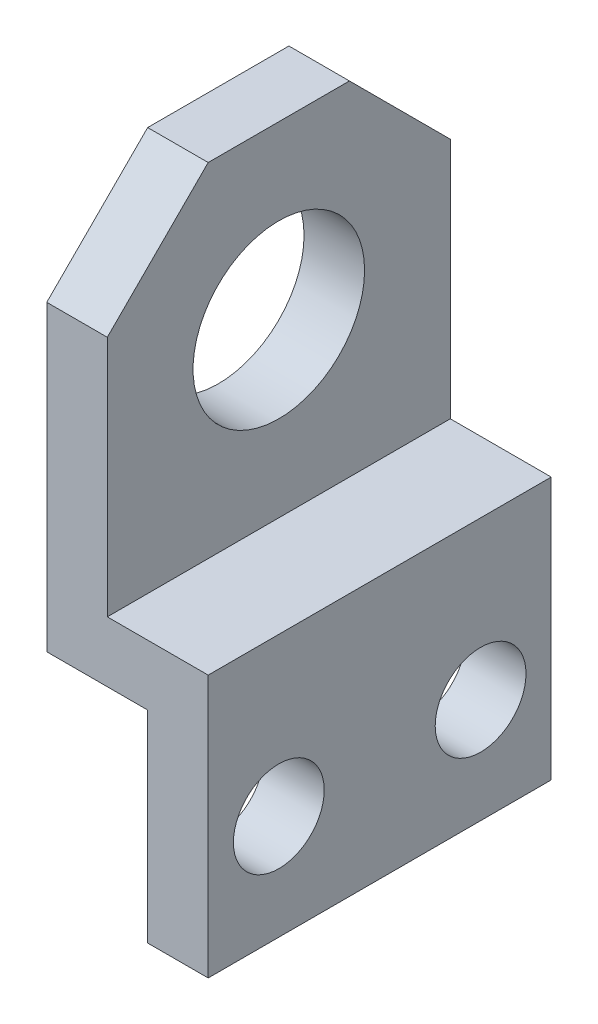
ISO-10303-21;
HEADER;
FILE_DESCRIPTION(('STEP AP214'),'2;1');
FILE_NAME('part.step','',(''),(''),'','','');
FILE_SCHEMA(('AUTOMOTIVE_DESIGN { 1 0 10303 214 1 1 1 1 }'));
ENDSEC;
DATA;
#1=APPLICATION_CONTEXT('core data for automotive mechanical design processes');
#2=APPLICATION_PROTOCOL_DEFINITION('international standard','automotive_design',2000,#1);
#3=PRODUCT_CONTEXT('',#1,'mechanical');
#4=PRODUCT('Part','Part','',(#3));
#5=PRODUCT_RELATED_PRODUCT_CATEGORY('part','',(#4));
#6=PRODUCT_DEFINITION_FORMATION('','',#4);
#7=PRODUCT_DEFINITION_CONTEXT('part definition',#1,'design');
#8=PRODUCT_DEFINITION('design','',#6,#7);
#9=PRODUCT_DEFINITION_SHAPE('','',#8);
#10=(LENGTH_UNIT() NAMED_UNIT(*) SI_UNIT(.MILLI.,.METRE.));
#11=(NAMED_UNIT(*) PLANE_ANGLE_UNIT() SI_UNIT($,.RADIAN.));
#12=(NAMED_UNIT(*) SI_UNIT($,.STERADIAN.) SOLID_ANGLE_UNIT());
#13=UNCERTAINTY_MEASURE_WITH_UNIT(LENGTH_MEASURE(1.E-05),#10,'distance_accuracy_value','');
#14=(GEOMETRIC_REPRESENTATION_CONTEXT(3) GLOBAL_UNCERTAINTY_ASSIGNED_CONTEXT((#13)) GLOBAL_UNIT_ASSIGNED_CONTEXT((#10,
#11,#12)) REPRESENTATION_CONTEXT('',''));
#15=CARTESIAN_POINT('',(0.,0.,0.));
#16=DIRECTION('',(0.,0.,1.));
#17=DIRECTION('',(1.,0.,0.));
#18=AXIS2_PLACEMENT_3D('',#15,#16,#17);
#19=CARTESIAN_POINT('',(5.,0.,8.5));
#20=DIRECTION('',(1.,0.,0.));
#21=DIRECTION('',(0.,1.,0.));
#22=AXIS2_PLACEMENT_3D('',#19,#20,#21);
#23=PLANE('',#22);
#24=CARTESIAN_POINT('',(5.,-4.80875633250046,5.));
#25=DIRECTION('',(-1.,0.,0.));
#26=DIRECTION('',(0.,-1.,0.));
#27=AXIS2_PLACEMENT_3D('',#24,#25,#26);
#28=CIRCLE('',#27,2.25);
#29=CARTESIAN_POINT('',(5.,-7.05875633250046,5.));
#30=VERTEX_POINT('',#29);
#31=EDGE_CURVE('E206',#30,#30,#28,.T.);
#32=ORIENTED_EDGE('',*,*,#31,.F.);
#33=EDGE_LOOP('',(#32));
#34=FACE_BOUND('',#33,.T.);
#35=CARTESIAN_POINT('',(5.,-4.80875633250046,-5.));
#36=DIRECTION('',(-1.,0.,0.));
#37=DIRECTION('',(0.,-1.,0.));
#38=AXIS2_PLACEMENT_3D('',#35,#36,#37);
#39=CIRCLE('',#38,2.25);
#40=CARTESIAN_POINT('',(5.,-7.05875633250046,-5.));
#41=VERTEX_POINT('',#40);
#42=EDGE_CURVE('E197',#41,#41,#39,.T.);
#43=ORIENTED_EDGE('',*,*,#42,.F.);
#44=EDGE_LOOP('',(#43));
#45=FACE_BOUND('',#44,.T.);
#46=DIRECTION('',(0.,-1.,0.));
#47=VECTOR('',#46,1.);
#48=CARTESIAN_POINT('',(5.,0.,-8.5));
#49=LINE('',#48,#47);
#50=CARTESIAN_POINT('',(5.,0.,-8.5));
#51=VERTEX_POINT('',#50);
#52=CARTESIAN_POINT('',(5.,-10.,-8.5));
#53=VERTEX_POINT('',#52);
#54=EDGE_CURVE('E129',#51,#53,#49,.T.);
#55=ORIENTED_EDGE('',*,*,#54,.T.);
#56=DIRECTION('',(0.,0.,-1.));
#57=VECTOR('',#56,1.);
#58=CARTESIAN_POINT('',(5.,-10.,8.5));
#59=LINE('',#58,#57);
#60=CARTESIAN_POINT('',(5.,-10.,8.5));
#61=VERTEX_POINT('',#60);
#62=EDGE_CURVE('E127',#61,#53,#59,.T.);
#63=ORIENTED_EDGE('',*,*,#62,.F.);
#64=DIRECTION('',(0.,-1.,0.));
#65=VECTOR('',#64,1.);
#66=CARTESIAN_POINT('',(5.,0.,8.5));
#67=LINE('',#66,#65);
#68=CARTESIAN_POINT('',(5.,0.,8.5));
#69=VERTEX_POINT('',#68);
#70=EDGE_CURVE('E112',#69,#61,#67,.T.);
#71=ORIENTED_EDGE('',*,*,#70,.F.);
#72=DIRECTION('',(0.,0.,-1.));
#73=VECTOR('',#72,1.);
#74=CARTESIAN_POINT('',(5.,0.,8.5));
#75=LINE('',#74,#73);
#76=EDGE_CURVE('E150',#69,#51,#75,.T.);
#77=ORIENTED_EDGE('',*,*,#76,.T.);
#78=EDGE_LOOP('',(#55,#63,#71,#77));
#79=FACE_BOUND('',#78,.T.);
#80=ADVANCED_FACE('F33',(#34,#45,#79),#23,.F.);
#81=CARTESIAN_POINT('',(8.,-10.,8.5));
#82=DIRECTION('',(0.,-1.,0.));
#83=DIRECTION('',(0.,0.,-1.));
#84=AXIS2_PLACEMENT_3D('',#81,#82,#83);
#85=PLANE('',#84);
#86=DIRECTION('',(-1.,0.,0.));
#87=VECTOR('',#86,1.);
#88=CARTESIAN_POINT('',(8.,-10.,-8.5));
#89=LINE('',#88,#87);
#90=CARTESIAN_POINT('',(8.,-10.,-8.5));
#91=VERTEX_POINT('',#90);
#92=EDGE_CURVE('E152',#91,#53,#89,.T.);
#93=ORIENTED_EDGE('',*,*,#92,.F.);
#94=DIRECTION('',(0.,0.,-1.));
#95=VECTOR('',#94,1.);
#96=CARTESIAN_POINT('',(8.,-10.,8.5));
#97=LINE('',#96,#95);
#98=CARTESIAN_POINT('',(8.,-10.,8.5));
#99=VERTEX_POINT('',#98);
#100=EDGE_CURVE('E134',#99,#91,#97,.T.);
#101=ORIENTED_EDGE('',*,*,#100,.F.);
#102=DIRECTION('',(-1.,0.,0.));
#103=VECTOR('',#102,1.);
#104=CARTESIAN_POINT('',(8.,-10.,8.5));
#105=LINE('',#104,#103);
#106=EDGE_CURVE('E117',#99,#61,#105,.T.);
#107=ORIENTED_EDGE('',*,*,#106,.T.);
#108=ORIENTED_EDGE('',*,*,#62,.T.);
#109=EDGE_LOOP('',(#93,#101,#107,#108));
#110=FACE_BOUND('',#109,.T.);
#111=ADVANCED_FACE('F136',(#110),#85,.T.);
#112=CARTESIAN_POINT('',(8.,0.,8.5));
#113=DIRECTION('',(1.,0.,0.));
#114=DIRECTION('',(0.,1.,0.));
#115=AXIS2_PLACEMENT_3D('',#112,#113,#114);
#116=PLANE('',#115);
#117=CARTESIAN_POINT('',(8.,-4.80875633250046,5.));
#118=DIRECTION('',(1.,0.,0.));
#119=DIRECTION('',(0.,1.,0.));
#120=AXIS2_PLACEMENT_3D('',#117,#118,#119);
#121=CIRCLE('',#120,2.25);
#122=CARTESIAN_POINT('',(8.,-2.55875633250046,5.));
#123=VERTEX_POINT('',#122);
#124=EDGE_CURVE('E37',#123,#123,#121,.T.);
#125=ORIENTED_EDGE('',*,*,#124,.F.);
#126=EDGE_LOOP('',(#125));
#127=FACE_BOUND('',#126,.T.);
#128=CARTESIAN_POINT('',(8.,-4.80875633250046,-5.));
#129=DIRECTION('',(1.,0.,0.));
#130=DIRECTION('',(0.,1.,0.));
#131=AXIS2_PLACEMENT_3D('',#128,#129,#130);
#132=CIRCLE('',#131,2.25);
#133=CARTESIAN_POINT('',(8.,-2.55875633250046,-5.));
#134=VERTEX_POINT('',#133);
#135=EDGE_CURVE('E195',#134,#134,#132,.T.);
#136=ORIENTED_EDGE('',*,*,#135,.F.);
#137=EDGE_LOOP('',(#136));
#138=FACE_BOUND('',#137,.T.);
#139=DIRECTION('',(0.,-1.,0.));
#140=VECTOR('',#139,1.);
#141=CARTESIAN_POINT('',(8.,0.,-8.5));
#142=LINE('',#141,#140);
#143=CARTESIAN_POINT('',(8.,3.,-8.5));
#144=VERTEX_POINT('',#143);
#145=EDGE_CURVE('E155',#144,#91,#142,.T.);
#146=ORIENTED_EDGE('',*,*,#145,.F.);
#147=DIRECTION('',(0.,0.,-1.));
#148=VECTOR('',#147,1.);
#149=CARTESIAN_POINT('',(8.,3.,8.5));
#150=LINE('',#149,#148);
#151=CARTESIAN_POINT('',(8.,3.,8.5));
#152=VERTEX_POINT('',#151);
#153=EDGE_CURVE('E177',#152,#144,#150,.T.);
#154=ORIENTED_EDGE('',*,*,#153,.F.);
#155=DIRECTION('',(0.,-1.,0.));
#156=VECTOR('',#155,1.);
#157=CARTESIAN_POINT('',(8.,0.,8.5));
#158=LINE('',#157,#156);
#159=EDGE_CURVE('E137',#152,#99,#158,.T.);
#160=ORIENTED_EDGE('',*,*,#159,.T.);
#161=ORIENTED_EDGE('',*,*,#100,.T.);
#162=EDGE_LOOP('',(#146,#154,#160,#161));
#163=FACE_BOUND('',#162,.T.);
#164=ADVANCED_FACE('F219',(#127,#138,#163),#116,.T.);
#165=CARTESIAN_POINT('',(0.,3.,8.5));
#166=DIRECTION('',(0.,1.,0.));
#167=DIRECTION('',(0.,0.,1.));
#168=AXIS2_PLACEMENT_3D('',#165,#166,#167);
#169=PLANE('',#168);
#170=DIRECTION('',(1.,0.,0.));
#171=VECTOR('',#170,1.);
#172=CARTESIAN_POINT('',(0.,3.,-8.5));
#173=LINE('',#172,#171);
#174=CARTESIAN_POINT('',(3.,3.,-8.5));
#175=VERTEX_POINT('',#174);
#176=EDGE_CURVE('E158',#175,#144,#173,.T.);
#177=ORIENTED_EDGE('',*,*,#176,.F.);
#178=DIRECTION('',(0.,0.,-1.));
#179=VECTOR('',#178,1.);
#180=CARTESIAN_POINT('',(3.,3.,8.5));
#181=LINE('',#180,#179);
#182=CARTESIAN_POINT('',(3.,3.,8.5));
#183=VERTEX_POINT('',#182);
#184=EDGE_CURVE('E174',#183,#175,#181,.T.);
#185=ORIENTED_EDGE('',*,*,#184,.F.);
#186=DIRECTION('',(1.,0.,0.));
#187=VECTOR('',#186,1.);
#188=CARTESIAN_POINT('',(0.,3.,8.5));
#189=LINE('',#188,#187);
#190=EDGE_CURVE('E139',#183,#152,#189,.T.);
#191=ORIENTED_EDGE('',*,*,#190,.T.);
#192=ORIENTED_EDGE('',*,*,#153,.T.);
#193=EDGE_LOOP('',(#177,#185,#191,#192));
#194=FACE_BOUND('',#193,.T.);
#195=ADVANCED_FACE('F254',(#194),#169,.T.);
#196=CARTESIAN_POINT('',(3.,0.,8.5));
#197=DIRECTION('',(1.,0.,0.));
#198=DIRECTION('',(0.,0.,-1.));
#199=AXIS2_PLACEMENT_3D('',#196,#197,#198);
#200=PLANE('',#199);
#201=CARTESIAN_POINT('',(3.,11.5,0.));
#202=DIRECTION('',(1.,0.,0.));
#203=DIRECTION('',(0.,0.,-1.));
#204=AXIS2_PLACEMENT_3D('',#201,#202,#203);
#205=CIRCLE('',#204,4.25);
#206=CARTESIAN_POINT('',(3.,11.5,-4.25));
#207=VERTEX_POINT('',#206);
#208=EDGE_CURVE('E194',#207,#207,#205,.T.);
#209=ORIENTED_EDGE('',*,*,#208,.F.);
#210=EDGE_LOOP('',(#209));
#211=FACE_BOUND('',#210,.T.);
#212=DIRECTION('',(0.,1.,0.));
#213=VECTOR('',#212,1.);
#214=CARTESIAN_POINT('',(3.,0.,-8.5));
#215=LINE('',#214,#213);
#216=CARTESIAN_POINT('',(3.,15.,-8.5));
#217=VERTEX_POINT('',#216);
#218=EDGE_CURVE('E161',#217,#175,#215,.F.);
#219=ORIENTED_EDGE('',*,*,#218,.F.);
#220=DIRECTION('',(0.,-0.707106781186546,-0.707106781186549));
#221=VECTOR('',#220,1.);
#222=CARTESIAN_POINT('',(3.,16.,-7.49999999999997));
#223=LINE('',#222,#221);
#224=CARTESIAN_POINT('',(3.,20.,-3.49999999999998));
#225=VERTEX_POINT('',#224);
#226=EDGE_CURVE('E184',#217,#225,#223,.F.);
#227=ORIENTED_EDGE('',*,*,#226,.T.);
#228=DIRECTION('',(0.,0.,-1.));
#229=VECTOR('',#228,1.);
#230=CARTESIAN_POINT('',(3.,20.,8.5));
#231=LINE('',#230,#229);
#232=CARTESIAN_POINT('',(3.,20.,3.5));
#233=VERTEX_POINT('',#232);
#234=EDGE_CURVE('E172',#233,#225,#231,.T.);
#235=ORIENTED_EDGE('',*,*,#234,.F.);
#236=DIRECTION('',(0.,-0.707106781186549,0.707106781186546));
#237=VECTOR('',#236,1.);
#238=CARTESIAN_POINT('',(3.,7.49999999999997,16.));
#239=LINE('',#238,#237);
#240=CARTESIAN_POINT('',(3.,15.,8.5));
#241=VERTEX_POINT('',#240);
#242=EDGE_CURVE('E182',#233,#241,#239,.T.);
#243=ORIENTED_EDGE('',*,*,#242,.T.);
#244=DIRECTION('',(0.,1.,0.));
#245=VECTOR('',#244,1.);
#246=CARTESIAN_POINT('',(3.,0.,8.5));
#247=LINE('',#246,#245);
#248=EDGE_CURVE('E145',#241,#183,#247,.F.);
#249=ORIENTED_EDGE('',*,*,#248,.T.);
#250=ORIENTED_EDGE('',*,*,#184,.T.);
#251=EDGE_LOOP('',(#219,#227,#235,#243,#249,#250));
#252=FACE_BOUND('',#251,.T.);
#253=ADVANCED_FACE('F249',(#211,#252),#200,.T.);
#254=CARTESIAN_POINT('',(0.,20.,8.5));
#255=DIRECTION('',(0.,1.,0.));
#256=DIRECTION('',(0.,0.,1.));
#257=AXIS2_PLACEMENT_3D('',#254,#255,#256);
#258=PLANE('',#257);
#259=ORIENTED_EDGE('',*,*,#234,.T.);
#260=DIRECTION('',(-1.,0.,0.));
#261=VECTOR('',#260,1.);
#262=CARTESIAN_POINT('',(0.,20.,-3.49999999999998));
#263=LINE('',#262,#261);
#264=CARTESIAN_POINT('',(0.,20.,-3.49999999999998));
#265=VERTEX_POINT('',#264);
#266=EDGE_CURVE('E56',#225,#265,#263,.T.);
#267=ORIENTED_EDGE('',*,*,#266,.T.);
#268=DIRECTION('',(0.,0.,-1.));
#269=VECTOR('',#268,1.);
#270=CARTESIAN_POINT('',(0.,20.,8.5));
#271=LINE('',#270,#269);
#272=CARTESIAN_POINT('',(0.,20.,3.5));
#273=VERTEX_POINT('',#272);
#274=EDGE_CURVE('E170',#273,#265,#271,.T.);
#275=ORIENTED_EDGE('',*,*,#274,.F.);
#276=DIRECTION('',(1.,0.,0.));
#277=VECTOR('',#276,1.);
#278=CARTESIAN_POINT('',(3.,20.,3.5));
#279=LINE('',#278,#277);
#280=EDGE_CURVE('E186',#273,#233,#279,.T.);
#281=ORIENTED_EDGE('',*,*,#280,.T.);
#282=EDGE_LOOP('',(#259,#267,#275,#281));
#283=FACE_BOUND('',#282,.T.);
#284=ADVANCED_FACE('F247',(#283),#258,.T.);
#285=CARTESIAN_POINT('',(0.,0.,8.5));
#286=DIRECTION('',(1.,0.,0.));
#287=DIRECTION('',(0.,0.,-1.));
#288=AXIS2_PLACEMENT_3D('',#285,#286,#287);
#289=PLANE('',#288);
#290=CARTESIAN_POINT('',(0.,11.5,0.));
#291=DIRECTION('',(1.,0.,0.));
#292=DIRECTION('',(0.,0.,-1.));
#293=AXIS2_PLACEMENT_3D('',#290,#291,#292);
#294=CIRCLE('',#293,4.25);
#295=CARTESIAN_POINT('',(0.,11.5,-4.25));
#296=VERTEX_POINT('',#295);
#297=EDGE_CURVE('E153',#296,#296,#294,.T.);
#298=ORIENTED_EDGE('',*,*,#297,.T.);
#299=EDGE_LOOP('',(#298));
#300=FACE_BOUND('',#299,.T.);
#301=ORIENTED_EDGE('',*,*,#274,.T.);
#302=DIRECTION('',(0.,0.707106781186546,0.707106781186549));
#303=VECTOR('',#302,1.);
#304=CARTESIAN_POINT('',(0.,15.,-8.5));
#305=LINE('',#304,#303);
#306=CARTESIAN_POINT('',(0.,15.,-8.5));
#307=VERTEX_POINT('',#306);
#308=EDGE_CURVE('E42',#265,#307,#305,.F.);
#309=ORIENTED_EDGE('',*,*,#308,.T.);
#310=DIRECTION('',(0.,-1.,0.));
#311=VECTOR('',#310,1.);
#312=CARTESIAN_POINT('',(0.,0.,-8.5));
#313=LINE('',#312,#311);
#314=CARTESIAN_POINT('',(0.,0.,-8.5));
#315=VERTEX_POINT('',#314);
#316=EDGE_CURVE('E163',#307,#315,#313,.T.);
#317=ORIENTED_EDGE('',*,*,#316,.T.);
#318=DIRECTION('',(0.,0.,-1.));
#319=VECTOR('',#318,1.);
#320=CARTESIAN_POINT('',(0.,0.,8.5));
#321=LINE('',#320,#319);
#322=CARTESIAN_POINT('',(0.,0.,8.5));
#323=VERTEX_POINT('',#322);
#324=EDGE_CURVE('E167',#323,#315,#321,.T.);
#325=ORIENTED_EDGE('',*,*,#324,.F.);
#326=DIRECTION('',(0.,-1.,0.));
#327=VECTOR('',#326,1.);
#328=CARTESIAN_POINT('',(0.,0.,8.5));
#329=LINE('',#328,#327);
#330=CARTESIAN_POINT('',(0.,15.,8.5));
#331=VERTEX_POINT('',#330);
#332=EDGE_CURVE('E147',#331,#323,#329,.T.);
#333=ORIENTED_EDGE('',*,*,#332,.F.);
#334=DIRECTION('',(0.,0.707106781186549,-0.707106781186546));
#335=VECTOR('',#334,1.);
#336=CARTESIAN_POINT('',(0.,20.,3.5));
#337=LINE('',#336,#335);
#338=EDGE_CURVE('E190',#331,#273,#337,.T.);
#339=ORIENTED_EDGE('',*,*,#338,.T.);
#340=EDGE_LOOP('',(#301,#309,#317,#325,#333,#339));
#341=FACE_BOUND('',#340,.T.);
#342=ADVANCED_FACE('F238',(#300,#341),#289,.F.);
#343=CARTESIAN_POINT('',(0.,0.,8.5));
#344=DIRECTION('',(0.,1.,0.));
#345=DIRECTION('',(0.,0.,1.));
#346=AXIS2_PLACEMENT_3D('',#343,#344,#345);
#347=PLANE('',#346);
#348=DIRECTION('',(1.,0.,0.));
#349=VECTOR('',#348,1.);
#350=CARTESIAN_POINT('',(0.,0.,-8.5));
#351=LINE('',#350,#349);
#352=EDGE_CURVE('E124',#315,#51,#351,.T.);
#353=ORIENTED_EDGE('',*,*,#352,.T.);
#354=ORIENTED_EDGE('',*,*,#76,.F.);
#355=DIRECTION('',(1.,0.,0.));
#356=VECTOR('',#355,1.);
#357=CARTESIAN_POINT('',(0.,0.,8.5));
#358=LINE('',#357,#356);
#359=EDGE_CURVE('E120',#323,#69,#358,.T.);
#360=ORIENTED_EDGE('',*,*,#359,.F.);
#361=ORIENTED_EDGE('',*,*,#324,.T.);
#362=EDGE_LOOP('',(#353,#354,#360,#361));
#363=FACE_BOUND('',#362,.T.);
#364=ADVANCED_FACE('F243',(#363),#347,.F.);
#365=CARTESIAN_POINT('',(5.,-10.,8.5));
#366=DIRECTION('',(0.,0.,-1.));
#367=DIRECTION('',(-1.,0.,0.));
#368=AXIS2_PLACEMENT_3D('',#365,#366,#367);
#369=PLANE('',#368);
#370=ORIENTED_EDGE('',*,*,#248,.F.);
#371=DIRECTION('',(-1.,0.,0.));
#372=VECTOR('',#371,1.);
#373=CARTESIAN_POINT('',(0.,15.,8.5));
#374=LINE('',#373,#372);
#375=EDGE_CURVE('E11',#241,#331,#374,.T.);
#376=ORIENTED_EDGE('',*,*,#375,.T.);
#377=ORIENTED_EDGE('',*,*,#332,.T.);
#378=ORIENTED_EDGE('',*,*,#359,.T.);
#379=ORIENTED_EDGE('',*,*,#70,.T.);
#380=ORIENTED_EDGE('',*,*,#106,.F.);
#381=ORIENTED_EDGE('',*,*,#159,.F.);
#382=ORIENTED_EDGE('',*,*,#190,.F.);
#383=EDGE_LOOP('',(#370,#376,#377,#378,#379,#380,#381,#382));
#384=FACE_BOUND('',#383,.T.);
#385=ADVANCED_FACE('F114',(#384),#369,.F.);
#386=CARTESIAN_POINT('',(5.,-10.,-8.5));
#387=DIRECTION('',(0.,0.,-1.));
#388=DIRECTION('',(-1.,0.,0.));
#389=AXIS2_PLACEMENT_3D('',#386,#387,#388);
#390=PLANE('',#389);
#391=ORIENTED_EDGE('',*,*,#316,.F.);
#392=DIRECTION('',(1.,0.,0.));
#393=VECTOR('',#392,1.);
#394=CARTESIAN_POINT('',(5.,15.,-8.5));
#395=LINE('',#394,#393);
#396=EDGE_CURVE('E133',#307,#217,#395,.T.);
#397=ORIENTED_EDGE('',*,*,#396,.T.);
#398=ORIENTED_EDGE('',*,*,#218,.T.);
#399=ORIENTED_EDGE('',*,*,#176,.T.);
#400=ORIENTED_EDGE('',*,*,#145,.T.);
#401=ORIENTED_EDGE('',*,*,#92,.T.);
#402=ORIENTED_EDGE('',*,*,#54,.F.);
#403=ORIENTED_EDGE('',*,*,#352,.F.);
#404=EDGE_LOOP('',(#391,#397,#398,#399,#400,#401,#402,#403));
#405=FACE_BOUND('',#404,.T.);
#406=ADVANCED_FACE('F224',(#405),#390,.T.);
#407=CARTESIAN_POINT('',(5.,15.,-8.5));
#408=DIRECTION('',(0.,-0.707106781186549,0.707106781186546));
#409=DIRECTION('',(0.,-0.707106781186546,-0.707106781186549));
#410=AXIS2_PLACEMENT_3D('',#407,#408,#409);
#411=PLANE('',#410);
#412=ORIENTED_EDGE('',*,*,#308,.F.);
#413=ORIENTED_EDGE('',*,*,#266,.F.);
#414=ORIENTED_EDGE('',*,*,#226,.F.);
#415=ORIENTED_EDGE('',*,*,#396,.F.);
#416=EDGE_LOOP('',(#412,#413,#414,#415));
#417=FACE_BOUND('',#416,.T.);
#418=ADVANCED_FACE('F222',(#417),#411,.F.);
#419=CARTESIAN_POINT('',(0.,20.,3.5));
#420=DIRECTION('',(0.,0.707106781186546,0.707106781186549));
#421=DIRECTION('',(0.,-0.707106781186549,0.707106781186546));
#422=AXIS2_PLACEMENT_3D('',#419,#420,#421);
#423=PLANE('',#422);
#424=ORIENTED_EDGE('',*,*,#338,.F.);
#425=ORIENTED_EDGE('',*,*,#375,.F.);
#426=ORIENTED_EDGE('',*,*,#242,.F.);
#427=ORIENTED_EDGE('',*,*,#280,.F.);
#428=EDGE_LOOP('',(#424,#425,#426,#427));
#429=FACE_BOUND('',#428,.T.);
#430=ADVANCED_FACE('F35',(#429),#423,.T.);
#431=CARTESIAN_POINT('',(-7.,11.5,0.));
#432=DIRECTION('',(1.,0.,0.));
#433=DIRECTION('',(0.,0.,-1.));
#434=AXIS2_PLACEMENT_3D('',#431,#432,#433);
#435=CYLINDRICAL_SURFACE('',#434,4.25);
#436=ORIENTED_EDGE('',*,*,#208,.T.);
#437=EDGE_LOOP('',(#436));
#438=FACE_BOUND('',#437,.T.);
#439=ORIENTED_EDGE('',*,*,#297,.F.);
#440=EDGE_LOOP('',(#439));
#441=FACE_BOUND('',#440,.T.);
#442=ADVANCED_FACE('F230',(#438,#441),#435,.F.);
#443=CARTESIAN_POINT('',(15.,-4.80875633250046,-5.));
#444=DIRECTION('',(-1.,0.,0.));
#445=DIRECTION('',(0.,-1.,0.));
#446=AXIS2_PLACEMENT_3D('',#443,#444,#445);
#447=CYLINDRICAL_SURFACE('',#446,2.25);
#448=ORIENTED_EDGE('',*,*,#135,.T.);
#449=EDGE_LOOP('',(#448));
#450=FACE_BOUND('',#449,.T.);
#451=ORIENTED_EDGE('',*,*,#42,.T.);
#452=EDGE_LOOP('',(#451));
#453=FACE_BOUND('',#452,.T.);
#454=ADVANCED_FACE('F280',(#450,#453),#447,.F.);
#455=CARTESIAN_POINT('',(15.,-4.80875633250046,5.));
#456=DIRECTION('',(-1.,0.,0.));
#457=DIRECTION('',(0.,-1.,0.));
#458=AXIS2_PLACEMENT_3D('',#455,#456,#457);
#459=CYLINDRICAL_SURFACE('',#458,2.25);
#460=ORIENTED_EDGE('',*,*,#124,.T.);
#461=EDGE_LOOP('',(#460));
#462=FACE_BOUND('',#461,.T.);
#463=ORIENTED_EDGE('',*,*,#31,.T.);
#464=EDGE_LOOP('',(#463));
#465=FACE_BOUND('',#464,.T.);
#466=ADVANCED_FACE('F211',(#462,#465),#459,.F.);
#467=CLOSED_SHELL('',(#80,#111,#164,#195,#253,#284,#342,#364,#385,#406,#418,#430,#442,#454,#466));
#468=MANIFOLD_SOLID_BREP('B2',#467);
#469=ADVANCED_BREP_SHAPE_REPRESENTATION('',(#18,#468),#14);
#470=SHAPE_DEFINITION_REPRESENTATION(#9,#469);
ENDSEC;
END-ISO-10303-21;
